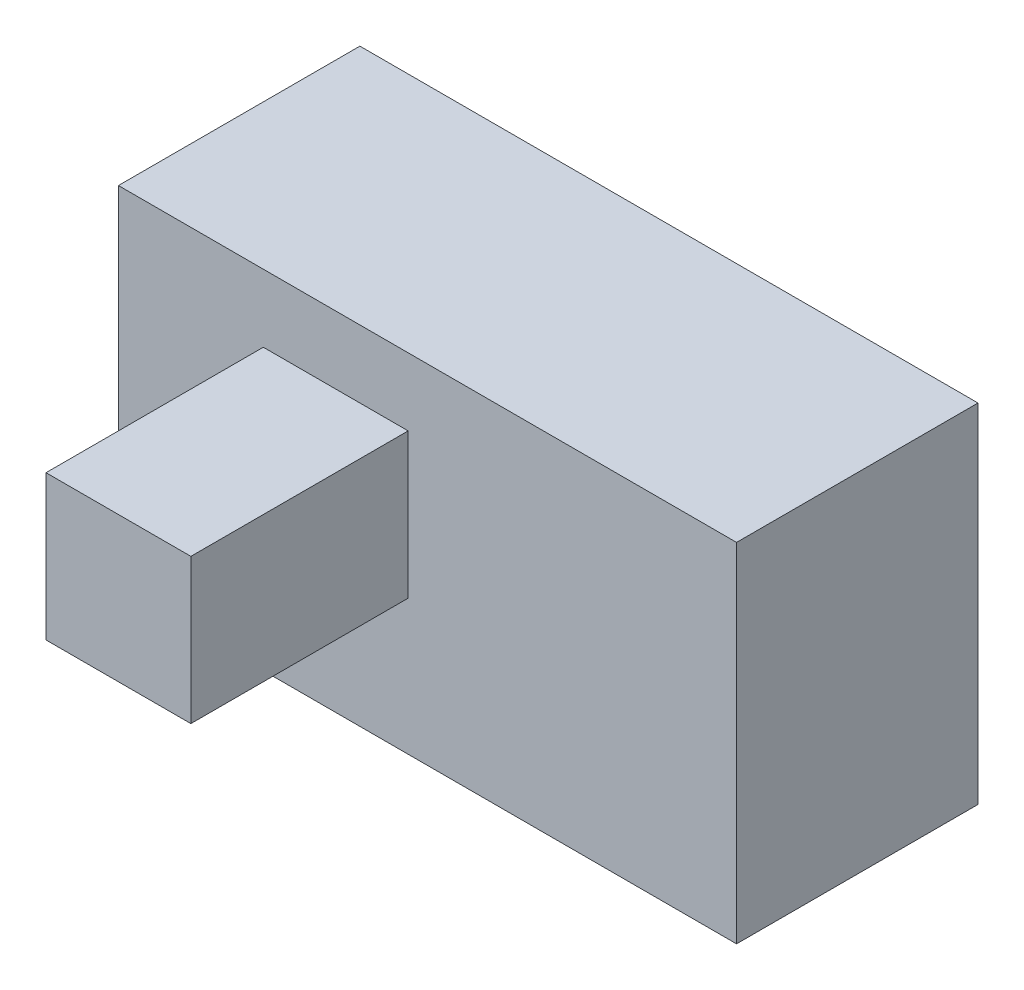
ISO-10303-21;
HEADER;
FILE_DESCRIPTION(('STEP AP214'),'2;1');
FILE_NAME('part.step','',(''),(''),'','','');
FILE_SCHEMA(('AUTOMOTIVE_DESIGN { 1 0 10303 214 1 1 1 1 }'));
ENDSEC;
DATA;
#1=APPLICATION_CONTEXT('core data for automotive mechanical design processes');
#2=APPLICATION_PROTOCOL_DEFINITION('international standard','automotive_design',2000,#1);
#3=PRODUCT_CONTEXT('',#1,'mechanical');
#4=PRODUCT('Part','Part','',(#3));
#5=PRODUCT_RELATED_PRODUCT_CATEGORY('part','',(#4));
#6=PRODUCT_DEFINITION_FORMATION('','',#4);
#7=PRODUCT_DEFINITION_CONTEXT('part definition',#1,'design');
#8=PRODUCT_DEFINITION('design','',#6,#7);
#9=PRODUCT_DEFINITION_SHAPE('','',#8);
#10=(LENGTH_UNIT() NAMED_UNIT(*) SI_UNIT(.MILLI.,.METRE.));
#11=(NAMED_UNIT(*) PLANE_ANGLE_UNIT() SI_UNIT($,.RADIAN.));
#12=(NAMED_UNIT(*) SI_UNIT($,.STERADIAN.) SOLID_ANGLE_UNIT());
#13=UNCERTAINTY_MEASURE_WITH_UNIT(LENGTH_MEASURE(1.E-05),#10,'distance_accuracy_value','');
#14=(GEOMETRIC_REPRESENTATION_CONTEXT(3) GLOBAL_UNCERTAINTY_ASSIGNED_CONTEXT((#13)) GLOBAL_UNIT_ASSIGNED_CONTEXT((#10,
#11,#12)) REPRESENTATION_CONTEXT('',''));
#15=CARTESIAN_POINT('',(0.,0.,0.));
#16=DIRECTION('',(0.,0.,1.));
#17=DIRECTION('',(1.,0.,0.));
#18=AXIS2_PLACEMENT_3D('',#15,#16,#17);
#19=CARTESIAN_POINT('',(0.,7.2,0.));
#20=DIRECTION('',(0.,0.,1.));
#21=DIRECTION('',(1.,0.,0.));
#22=AXIS2_PLACEMENT_3D('',#19,#20,#21);
#23=PLANE('',#22);
#24=CARTESIAN_POINT('',(2.16,3.6,0.));
#25=DIRECTION('',(0.,0.,1.));
#26=DIRECTION('',(1.,0.,0.));
#27=AXIS2_PLACEMENT_3D('',#24,#25,#26);
#28=CIRCLE('',#27,0.25);
#29=CARTESIAN_POINT('',(2.41,3.6,0.));
#30=VERTEX_POINT('',#29);
#31=EDGE_CURVE('E235',#30,#30,#28,.T.);
#32=ORIENTED_EDGE('',*,*,#31,.T.);
#33=EDGE_LOOP('',(#32));
#34=FACE_BOUND('',#33,.T.);
#35=CARTESIAN_POINT('',(7.24000000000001,3.6,0.));
#36=DIRECTION('',(0.,0.,1.));
#37=DIRECTION('',(1.,0.,0.));
#38=AXIS2_PLACEMENT_3D('',#35,#36,#37);
#39=CIRCLE('',#38,0.25);
#40=CARTESIAN_POINT('',(7.49000000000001,3.6,0.));
#41=VERTEX_POINT('',#40);
#42=EDGE_CURVE('E234',#41,#41,#39,.T.);
#43=ORIENTED_EDGE('',*,*,#42,.T.);
#44=EDGE_LOOP('',(#43));
#45=FACE_BOUND('',#44,.T.);
#46=DIRECTION('',(0.,1.,0.));
#47=VECTOR('',#46,1.);
#48=CARTESIAN_POINT('',(0.,0.,0.));
#49=LINE('',#48,#47);
#50=CARTESIAN_POINT('',(0.,0.,0.));
#51=VERTEX_POINT('',#50);
#52=CARTESIAN_POINT('',(0.,7.2,0.));
#53=VERTEX_POINT('',#52);
#54=EDGE_CURVE('E126',#51,#53,#49,.T.);
#55=ORIENTED_EDGE('',*,*,#54,.T.);
#56=DIRECTION('',(-1.,0.,0.));
#57=VECTOR('',#56,1.);
#58=CARTESIAN_POINT('',(12.8,7.2,0.));
#59=LINE('',#58,#57);
#60=CARTESIAN_POINT('',(12.8,7.2,0.));
#61=VERTEX_POINT('',#60);
#62=EDGE_CURVE('E129',#61,#53,#59,.T.);
#63=ORIENTED_EDGE('',*,*,#62,.F.);
#64=DIRECTION('',(0.,-1.,0.));
#65=VECTOR('',#64,1.);
#66=CARTESIAN_POINT('',(12.8,7.2,0.));
#67=LINE('',#66,#65);
#68=CARTESIAN_POINT('',(12.8,0.,0.));
#69=VERTEX_POINT('',#68);
#70=EDGE_CURVE('E132',#61,#69,#67,.T.);
#71=ORIENTED_EDGE('',*,*,#70,.T.);
#72=DIRECTION('',(1.,0.,0.));
#73=VECTOR('',#72,1.);
#74=CARTESIAN_POINT('',(0.,0.,0.));
#75=LINE('',#74,#73);
#76=EDGE_CURVE('E135',#51,#69,#75,.T.);
#77=ORIENTED_EDGE('',*,*,#76,.F.);
#78=EDGE_LOOP('',(#55,#63,#71,#77));
#79=FACE_BOUND('',#78,.T.);
#80=CARTESIAN_POINT('',(6.4,3.6,0.));
#81=DIRECTION('',(0.,0.,1.));
#82=DIRECTION('',(1.,0.,0.));
#83=AXIS2_PLACEMENT_3D('',#80,#81,#82);
#84=CIRCLE('',#83,0.25);
#85=CARTESIAN_POINT('',(6.65,3.6,0.));
#86=VERTEX_POINT('',#85);
#87=EDGE_CURVE('E11',#86,#86,#84,.F.);
#88=ORIENTED_EDGE('',*,*,#87,.F.);
#89=EDGE_LOOP('',(#88));
#90=FACE_BOUND('',#89,.T.);
#91=ADVANCED_FACE('F26',(#34,#45,#79,#90),#23,.F.);
#92=CARTESIAN_POINT('',(0.,7.2,5.));
#93=DIRECTION('',(0.,0.,1.));
#94=DIRECTION('',(1.,0.,0.));
#95=AXIS2_PLACEMENT_3D('',#92,#93,#94);
#96=PLANE('',#95);
#97=DIRECTION('',(0.,1.,0.));
#98=VECTOR('',#97,1.);
#99=CARTESIAN_POINT('',(0.,0.,5.));
#100=LINE('',#99,#98);
#101=CARTESIAN_POINT('',(0.,0.,5.));
#102=VERTEX_POINT('',#101);
#103=CARTESIAN_POINT('',(0.,7.2,5.));
#104=VERTEX_POINT('',#103);
#105=EDGE_CURVE('E138',#102,#104,#100,.T.);
#106=ORIENTED_EDGE('',*,*,#105,.F.);
#107=DIRECTION('',(1.,0.,0.));
#108=VECTOR('',#107,1.);
#109=CARTESIAN_POINT('',(0.,0.,5.));
#110=LINE('',#109,#108);
#111=CARTESIAN_POINT('',(12.8,0.,5.));
#112=VERTEX_POINT('',#111);
#113=EDGE_CURVE('E146',#102,#112,#110,.T.);
#114=ORIENTED_EDGE('',*,*,#113,.T.);
#115=DIRECTION('',(0.,-1.,0.));
#116=VECTOR('',#115,1.);
#117=CARTESIAN_POINT('',(12.8,7.2,5.));
#118=LINE('',#117,#116);
#119=CARTESIAN_POINT('',(12.8,7.2,5.));
#120=VERTEX_POINT('',#119);
#121=EDGE_CURVE('E143',#120,#112,#118,.T.);
#122=ORIENTED_EDGE('',*,*,#121,.F.);
#123=DIRECTION('',(-1.,0.,0.));
#124=VECTOR('',#123,1.);
#125=CARTESIAN_POINT('',(12.8,7.2,5.));
#126=LINE('',#125,#124);
#127=EDGE_CURVE('E141',#120,#104,#126,.T.);
#128=ORIENTED_EDGE('',*,*,#127,.T.);
#129=EDGE_LOOP('',(#106,#114,#122,#128));
#130=FACE_BOUND('',#129,.T.);
#131=DIRECTION('',(-1.,0.,0.));
#132=VECTOR('',#131,1.);
#133=CARTESIAN_POINT('',(6.,2.8,5.));
#134=LINE('',#133,#132);
#135=CARTESIAN_POINT('',(6.,2.8,5.));
#136=VERTEX_POINT('',#135);
#137=CARTESIAN_POINT('',(3.,2.8,5.));
#138=VERTEX_POINT('',#137);
#139=EDGE_CURVE('E41',#136,#138,#134,.T.);
#140=ORIENTED_EDGE('',*,*,#139,.T.);
#141=DIRECTION('',(0.,-1.,0.));
#142=VECTOR('',#141,1.);
#143=CARTESIAN_POINT('',(3.,5.8,5.));
#144=LINE('',#143,#142);
#145=CARTESIAN_POINT('',(3.,5.8,5.));
#146=VERTEX_POINT('',#145);
#147=EDGE_CURVE('E88',#146,#138,#144,.T.);
#148=ORIENTED_EDGE('',*,*,#147,.F.);
#149=DIRECTION('',(1.,0.,0.));
#150=VECTOR('',#149,1.);
#151=CARTESIAN_POINT('',(3.,5.8,5.));
#152=LINE('',#151,#150);
#153=CARTESIAN_POINT('',(6.,5.8,5.));
#154=VERTEX_POINT('',#153);
#155=EDGE_CURVE('E92',#146,#154,#152,.T.);
#156=ORIENTED_EDGE('',*,*,#155,.T.);
#157=DIRECTION('',(0.,1.,0.));
#158=VECTOR('',#157,1.);
#159=CARTESIAN_POINT('',(6.,2.8,5.));
#160=LINE('',#159,#158);
#161=EDGE_CURVE('E46',#136,#154,#160,.T.);
#162=ORIENTED_EDGE('',*,*,#161,.F.);
#163=EDGE_LOOP('',(#140,#148,#156,#162));
#164=FACE_BOUND('',#163,.T.);
#165=ADVANCED_FACE('F90',(#130,#164),#96,.T.);
#166=CARTESIAN_POINT('',(0.,0.,5.));
#167=DIRECTION('',(-1.,0.,0.));
#168=DIRECTION('',(0.,-1.,0.));
#169=AXIS2_PLACEMENT_3D('',#166,#167,#168);
#170=PLANE('',#169);
#171=ORIENTED_EDGE('',*,*,#54,.F.);
#172=DIRECTION('',(0.,0.,-1.));
#173=VECTOR('',#172,1.);
#174=CARTESIAN_POINT('',(0.,0.,5.));
#175=LINE('',#174,#173);
#176=EDGE_CURVE('E34',#102,#51,#175,.T.);
#177=ORIENTED_EDGE('',*,*,#176,.F.);
#178=ORIENTED_EDGE('',*,*,#105,.T.);
#179=DIRECTION('',(0.,0.,-1.));
#180=VECTOR('',#179,1.);
#181=CARTESIAN_POINT('',(0.,7.2,5.));
#182=LINE('',#181,#180);
#183=EDGE_CURVE('E148',#104,#53,#182,.T.);
#184=ORIENTED_EDGE('',*,*,#183,.T.);
#185=EDGE_LOOP('',(#171,#177,#178,#184));
#186=FACE_BOUND('',#185,.T.);
#187=ADVANCED_FACE('F28',(#186),#170,.T.);
#188=CARTESIAN_POINT('',(0.,0.,5.));
#189=DIRECTION('',(0.,1.,0.));
#190=DIRECTION('',(0.,0.,1.));
#191=AXIS2_PLACEMENT_3D('',#188,#189,#190);
#192=PLANE('',#191);
#193=ORIENTED_EDGE('',*,*,#76,.T.);
#194=DIRECTION('',(0.,0.,-1.));
#195=VECTOR('',#194,1.);
#196=CARTESIAN_POINT('',(12.8,0.,5.));
#197=LINE('',#196,#195);
#198=EDGE_CURVE('E150',#112,#69,#197,.T.);
#199=ORIENTED_EDGE('',*,*,#198,.F.);
#200=ORIENTED_EDGE('',*,*,#113,.F.);
#201=ORIENTED_EDGE('',*,*,#176,.T.);
#202=EDGE_LOOP('',(#193,#199,#200,#201));
#203=FACE_BOUND('',#202,.T.);
#204=ADVANCED_FACE('F167',(#203),#192,.F.);
#205=CARTESIAN_POINT('',(12.8,7.2,5.));
#206=DIRECTION('',(1.,0.,0.));
#207=DIRECTION('',(0.,1.,0.));
#208=AXIS2_PLACEMENT_3D('',#205,#206,#207);
#209=PLANE('',#208);
#210=ORIENTED_EDGE('',*,*,#70,.F.);
#211=DIRECTION('',(0.,0.,-1.));
#212=VECTOR('',#211,1.);
#213=CARTESIAN_POINT('',(12.8,7.2,5.));
#214=LINE('',#213,#212);
#215=EDGE_CURVE('E152',#120,#61,#214,.T.);
#216=ORIENTED_EDGE('',*,*,#215,.F.);
#217=ORIENTED_EDGE('',*,*,#121,.T.);
#218=ORIENTED_EDGE('',*,*,#198,.T.);
#219=EDGE_LOOP('',(#210,#216,#217,#218));
#220=FACE_BOUND('',#219,.T.);
#221=ADVANCED_FACE('F172',(#220),#209,.T.);
#222=CARTESIAN_POINT('',(12.8,7.2,5.));
#223=DIRECTION('',(0.,-1.,0.));
#224=DIRECTION('',(0.,0.,-1.));
#225=AXIS2_PLACEMENT_3D('',#222,#223,#224);
#226=PLANE('',#225);
#227=ORIENTED_EDGE('',*,*,#62,.T.);
#228=ORIENTED_EDGE('',*,*,#183,.F.);
#229=ORIENTED_EDGE('',*,*,#127,.F.);
#230=ORIENTED_EDGE('',*,*,#215,.T.);
#231=EDGE_LOOP('',(#227,#228,#229,#230));
#232=FACE_BOUND('',#231,.T.);
#233=ADVANCED_FACE('F160',(#232),#226,.F.);
#234=CARTESIAN_POINT('',(3.,5.8,9.5));
#235=DIRECTION('',(1.,0.,0.));
#236=DIRECTION('',(0.,1.,0.));
#237=AXIS2_PLACEMENT_3D('',#234,#235,#236);
#238=PLANE('',#237);
#239=ORIENTED_EDGE('',*,*,#147,.T.);
#240=DIRECTION('',(0.,0.,-1.));
#241=VECTOR('',#240,1.);
#242=CARTESIAN_POINT('',(3.,2.8,9.5));
#243=LINE('',#242,#241);
#244=CARTESIAN_POINT('',(3.,2.8,9.5));
#245=VERTEX_POINT('',#244);
#246=EDGE_CURVE('E124',#245,#138,#243,.T.);
#247=ORIENTED_EDGE('',*,*,#246,.F.);
#248=DIRECTION('',(0.,-1.,0.));
#249=VECTOR('',#248,1.);
#250=CARTESIAN_POINT('',(3.,5.8,9.5));
#251=LINE('',#250,#249);
#252=CARTESIAN_POINT('',(3.,5.8,9.5));
#253=VERTEX_POINT('',#252);
#254=EDGE_CURVE('E101',#253,#245,#251,.T.);
#255=ORIENTED_EDGE('',*,*,#254,.F.);
#256=DIRECTION('',(0.,0.,-1.));
#257=VECTOR('',#256,1.);
#258=CARTESIAN_POINT('',(3.,5.8,9.5));
#259=LINE('',#258,#257);
#260=EDGE_CURVE('E99',#253,#146,#259,.T.);
#261=ORIENTED_EDGE('',*,*,#260,.T.);
#262=EDGE_LOOP('',(#239,#247,#255,#261));
#263=FACE_BOUND('',#262,.T.);
#264=ADVANCED_FACE('F100',(#263),#238,.F.);
#265=CARTESIAN_POINT('',(6.,2.8,9.5));
#266=DIRECTION('',(0.,-1.,0.));
#267=DIRECTION('',(1.,0.,0.));
#268=AXIS2_PLACEMENT_3D('',#265,#266,#267);
#269=PLANE('',#268);
#270=ORIENTED_EDGE('',*,*,#139,.F.);
#271=DIRECTION('',(0.,0.,-1.));
#272=VECTOR('',#271,1.);
#273=CARTESIAN_POINT('',(6.,2.8,9.5));
#274=LINE('',#273,#272);
#275=CARTESIAN_POINT('',(6.,2.8,9.5));
#276=VERTEX_POINT('',#275);
#277=EDGE_CURVE('E122',#276,#136,#274,.T.);
#278=ORIENTED_EDGE('',*,*,#277,.F.);
#279=DIRECTION('',(-1.,0.,0.));
#280=VECTOR('',#279,1.);
#281=CARTESIAN_POINT('',(6.,2.8,9.5));
#282=LINE('',#281,#280);
#283=EDGE_CURVE('E111',#276,#245,#282,.T.);
#284=ORIENTED_EDGE('',*,*,#283,.T.);
#285=ORIENTED_EDGE('',*,*,#246,.T.);
#286=EDGE_LOOP('',(#270,#278,#284,#285));
#287=FACE_BOUND('',#286,.T.);
#288=ADVANCED_FACE('F194',(#287),#269,.T.);
#289=CARTESIAN_POINT('',(6.,2.8,9.5));
#290=DIRECTION('',(-1.,0.,0.));
#291=DIRECTION('',(0.,0.,1.));
#292=AXIS2_PLACEMENT_3D('',#289,#290,#291);
#293=PLANE('',#292);
#294=ORIENTED_EDGE('',*,*,#161,.T.);
#295=DIRECTION('',(0.,0.,-1.));
#296=VECTOR('',#295,1.);
#297=CARTESIAN_POINT('',(6.,5.8,9.5));
#298=LINE('',#297,#296);
#299=CARTESIAN_POINT('',(6.,5.8,9.5));
#300=VERTEX_POINT('',#299);
#301=EDGE_CURVE('E105',#300,#154,#298,.T.);
#302=ORIENTED_EDGE('',*,*,#301,.F.);
#303=DIRECTION('',(0.,1.,0.));
#304=VECTOR('',#303,1.);
#305=CARTESIAN_POINT('',(6.,2.8,9.5));
#306=LINE('',#305,#304);
#307=EDGE_CURVE('E118',#276,#300,#306,.T.);
#308=ORIENTED_EDGE('',*,*,#307,.F.);
#309=ORIENTED_EDGE('',*,*,#277,.T.);
#310=EDGE_LOOP('',(#294,#302,#308,#309));
#311=FACE_BOUND('',#310,.T.);
#312=ADVANCED_FACE('F197',(#311),#293,.F.);
#313=CARTESIAN_POINT('',(3.,5.8,9.5));
#314=DIRECTION('',(0.,1.,0.));
#315=DIRECTION('',(0.,0.,1.));
#316=AXIS2_PLACEMENT_3D('',#313,#314,#315);
#317=PLANE('',#316);
#318=ORIENTED_EDGE('',*,*,#155,.F.);
#319=ORIENTED_EDGE('',*,*,#260,.F.);
#320=DIRECTION('',(1.,0.,0.));
#321=VECTOR('',#320,1.);
#322=CARTESIAN_POINT('',(3.,5.8,9.5));
#323=LINE('',#322,#321);
#324=EDGE_CURVE('E106',#253,#300,#323,.T.);
#325=ORIENTED_EDGE('',*,*,#324,.T.);
#326=ORIENTED_EDGE('',*,*,#301,.T.);
#327=EDGE_LOOP('',(#318,#319,#325,#326));
#328=FACE_BOUND('',#327,.T.);
#329=ADVANCED_FACE('F108',(#328),#317,.T.);
#330=CARTESIAN_POINT('',(3.,5.8,9.5));
#331=DIRECTION('',(0.,0.,1.));
#332=DIRECTION('',(1.,0.,0.));
#333=AXIS2_PLACEMENT_3D('',#330,#331,#332);
#334=PLANE('',#333);
#335=ORIENTED_EDGE('',*,*,#254,.T.);
#336=ORIENTED_EDGE('',*,*,#283,.F.);
#337=ORIENTED_EDGE('',*,*,#307,.T.);
#338=ORIENTED_EDGE('',*,*,#324,.F.);
#339=EDGE_LOOP('',(#335,#336,#337,#338));
#340=FACE_BOUND('',#339,.T.);
#341=ADVANCED_FACE('F204',(#340),#334,.T.);
#342=CARTESIAN_POINT('',(6.4,3.6,-2.58088436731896));
#343=DIRECTION('',(0.,0.,1.));
#344=DIRECTION('',(1.,0.,0.));
#345=AXIS2_PLACEMENT_3D('',#342,#343,#344);
#346=CYLINDRICAL_SURFACE('',#345,0.25);
#347=CARTESIAN_POINT('',(6.4,3.6,-2.58088436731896));
#348=DIRECTION('',(0.,0.,-1.));
#349=DIRECTION('',(-1.,0.,0.));
#350=AXIS2_PLACEMENT_3D('',#347,#348,#349);
#351=CIRCLE('',#350,0.25);
#352=CARTESIAN_POINT('',(6.15,3.6,-2.58088436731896));
#353=VERTEX_POINT('',#352);
#354=EDGE_CURVE('E96',#353,#353,#351,.T.);
#355=ORIENTED_EDGE('',*,*,#354,.F.);
#356=EDGE_LOOP('',(#355));
#357=FACE_BOUND('',#356,.T.);
#358=ORIENTED_EDGE('',*,*,#87,.T.);
#359=EDGE_LOOP('',(#358));
#360=FACE_BOUND('',#359,.T.);
#361=ADVANCED_FACE('F207',(#357,#360),#346,.T.);
#362=CARTESIAN_POINT('',(6.4,3.6,-2.58088436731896));
#363=DIRECTION('',(0.,0.,-1.));
#364=DIRECTION('',(-1.,0.,0.));
#365=AXIS2_PLACEMENT_3D('',#362,#363,#364);
#366=PLANE('',#365);
#367=ORIENTED_EDGE('',*,*,#354,.T.);
#368=EDGE_LOOP('',(#367));
#369=FACE_BOUND('',#368,.T.);
#370=ADVANCED_FACE('F211',(#369),#366,.T.);
#371=CARTESIAN_POINT('',(7.24000000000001,3.6,-2.58088436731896));
#372=DIRECTION('',(0.,0.,1.));
#373=DIRECTION('',(1.,0.,0.));
#374=AXIS2_PLACEMENT_3D('',#371,#372,#373);
#375=CYLINDRICAL_SURFACE('',#374,0.25);
#376=CARTESIAN_POINT('',(7.24000000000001,3.6,-2.58088436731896));
#377=DIRECTION('',(0.,0.,1.));
#378=DIRECTION('',(1.,0.,0.));
#379=AXIS2_PLACEMENT_3D('',#376,#377,#378);
#380=CIRCLE('',#379,0.25);
#381=CARTESIAN_POINT('',(7.49000000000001,3.6,-2.58088436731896));
#382=VERTEX_POINT('',#381);
#383=EDGE_CURVE('E238',#382,#382,#380,.T.);
#384=ORIENTED_EDGE('',*,*,#383,.T.);
#385=EDGE_LOOP('',(#384));
#386=FACE_BOUND('',#385,.T.);
#387=ORIENTED_EDGE('',*,*,#42,.F.);
#388=EDGE_LOOP('',(#387));
#389=FACE_BOUND('',#388,.T.);
#390=ADVANCED_FACE('F215',(#386,#389),#375,.T.);
#391=CARTESIAN_POINT('',(7.24000000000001,3.6,-2.58088436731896));
#392=DIRECTION('',(0.,0.,-1.));
#393=DIRECTION('',(1.,0.,0.));
#394=AXIS2_PLACEMENT_3D('',#391,#392,#393);
#395=PLANE('',#394);
#396=ORIENTED_EDGE('',*,*,#383,.F.);
#397=EDGE_LOOP('',(#396));
#398=FACE_BOUND('',#397,.T.);
#399=ADVANCED_FACE('F219',(#398),#395,.T.);
#400=CARTESIAN_POINT('',(2.16,3.6,-2.58088436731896));
#401=DIRECTION('',(0.,0.,1.));
#402=DIRECTION('',(1.,0.,0.));
#403=AXIS2_PLACEMENT_3D('',#400,#401,#402);
#404=CYLINDRICAL_SURFACE('',#403,0.25);
#405=CARTESIAN_POINT('',(2.16,3.6,-2.58088436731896));
#406=DIRECTION('',(0.,0.,1.));
#407=DIRECTION('',(1.,0.,0.));
#408=AXIS2_PLACEMENT_3D('',#405,#406,#407);
#409=CIRCLE('',#408,0.25);
#410=CARTESIAN_POINT('',(2.41,3.6,-2.58088436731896));
#411=VERTEX_POINT('',#410);
#412=EDGE_CURVE('E233',#411,#411,#409,.T.);
#413=ORIENTED_EDGE('',*,*,#412,.T.);
#414=EDGE_LOOP('',(#413));
#415=FACE_BOUND('',#414,.T.);
#416=ORIENTED_EDGE('',*,*,#31,.F.);
#417=EDGE_LOOP('',(#416));
#418=FACE_BOUND('',#417,.T.);
#419=ADVANCED_FACE('F222',(#415,#418),#404,.T.);
#420=CARTESIAN_POINT('',(2.16,3.6,-2.58088436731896));
#421=DIRECTION('',(0.,0.,-1.));
#422=DIRECTION('',(1.,0.,0.));
#423=AXIS2_PLACEMENT_3D('',#420,#421,#422);
#424=PLANE('',#423);
#425=ORIENTED_EDGE('',*,*,#412,.F.);
#426=EDGE_LOOP('',(#425));
#427=FACE_BOUND('',#426,.T.);
#428=ADVANCED_FACE('F225',(#427),#424,.T.);
#429=CLOSED_SHELL('',(#91,#165,#187,#204,#221,#233,#264,#288,#312,#329,#341,#361,#370,#390,#399,
#419,#428));
#430=MANIFOLD_SOLID_BREP('B2',#429);
#431=ADVANCED_BREP_SHAPE_REPRESENTATION('',(#18,#430),#14);
#432=SHAPE_DEFINITION_REPRESENTATION(#9,#431);
ENDSEC;
END-ISO-10303-21;
